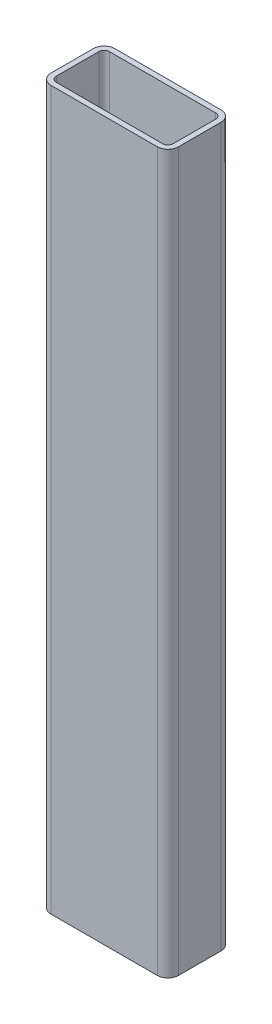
from build123d import *

# Parameters (mm, degrees)
STRUCTURAL_MEMBER1_DEPTH = 1714.5


with BuildPart() as part:
    # Sketch14 → Structural Member1 (new body)
    with BuildSketch(Plane(origin=(-991.461745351, -382.621637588, -76.2), x_dir=(0, 0, 1), z_dir=(0, -1, 0))):
        with BuildLine():
            Line((-50.8, -152.4), (50.8, -152.4))
            ThreePointArc((50.8, -152.4), (68.760512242, -144.960512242), (76.2, -127))
            Line((76.2, -127), (76.2, 127))
            ThreePointArc((76.2, 127), (68.760512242, 144.960512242), (50.8, 152.4))
            Line((50.8, 152.4), (-50.8, 152.4))
            ThreePointArc((-50.8, 152.4), (-68.760512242, 144.960512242), (-76.2, 127))
            Line((-76.2, 127), (-76.2, -127))
            ThreePointArc((-76.2, -127), (-68.760512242, -144.960512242), (-50.8, -152.4))
        make_face()
        with BuildLine():
            Line((-50.8, -139.7), (50.8, -139.7))
            ThreePointArc((50.8, -139.7), (59.780256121, -135.980256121), (63.5, -127))
            Line((63.5, -127), (63.5, 127))
            ThreePointArc((63.5, 127), (59.780256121, 135.980256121), (50.8, 139.7))
            Line((50.8, 139.7), (-50.8, 139.7))
            ThreePointArc((-50.8, 139.7), (-59.780256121, 135.980256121), (-63.5, 127))
            Line((-63.5, 127), (-63.5, -127))
            ThreePointArc((-63.5, -127), (-59.780256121, -135.980256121), (-50.8, -139.7))
        make_face(mode=Mode.SUBTRACT)
    extrude(amount=STRUCTURAL_MEMBER1_DEPTH)


solid = part.part
